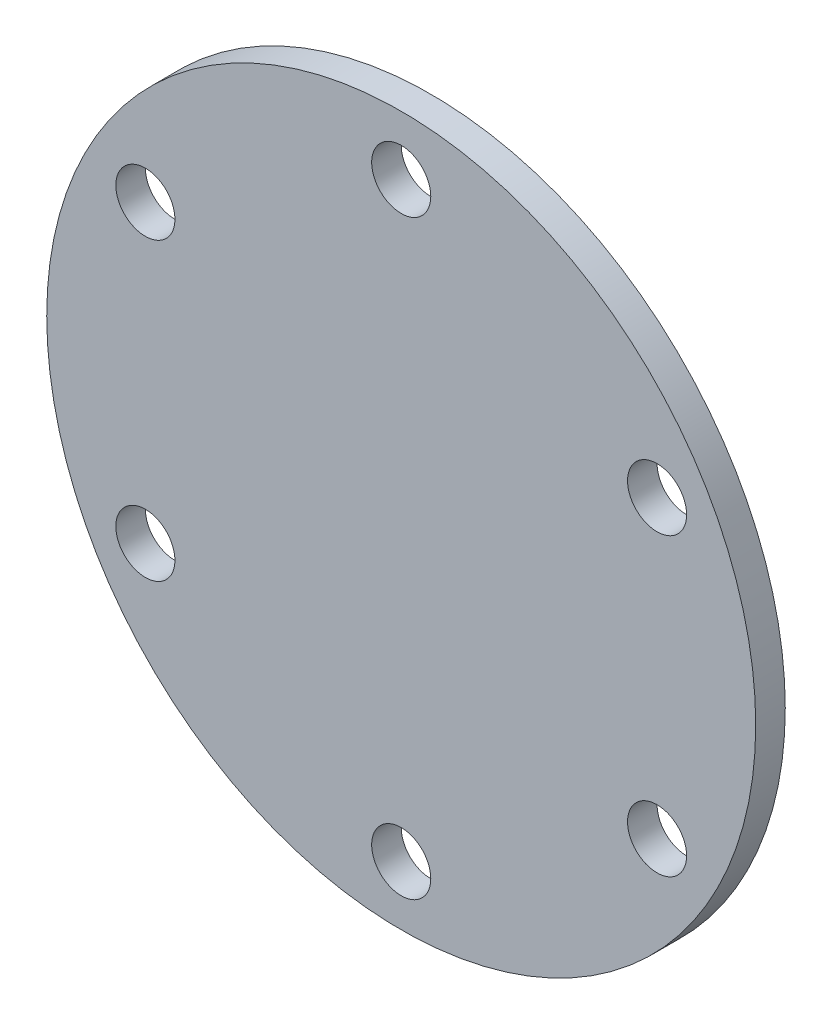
ISO-10303-21;
HEADER;
FILE_DESCRIPTION(('STEP AP214'),'2;1');
FILE_NAME('part.step','',(''),(''),'','','');
FILE_SCHEMA(('AUTOMOTIVE_DESIGN { 1 0 10303 214 1 1 1 1 }'));
ENDSEC;
DATA;
#1=APPLICATION_CONTEXT('core data for automotive mechanical design processes');
#2=APPLICATION_PROTOCOL_DEFINITION('international standard','automotive_design',2000,#1);
#3=PRODUCT_CONTEXT('',#1,'mechanical');
#4=PRODUCT('Part','Part','',(#3));
#5=PRODUCT_RELATED_PRODUCT_CATEGORY('part','',(#4));
#6=PRODUCT_DEFINITION_FORMATION('','',#4);
#7=PRODUCT_DEFINITION_CONTEXT('part definition',#1,'design');
#8=PRODUCT_DEFINITION('design','',#6,#7);
#9=PRODUCT_DEFINITION_SHAPE('','',#8);
#10=(LENGTH_UNIT() NAMED_UNIT(*) SI_UNIT(.MILLI.,.METRE.));
#11=(NAMED_UNIT(*) PLANE_ANGLE_UNIT() SI_UNIT($,.RADIAN.));
#12=(NAMED_UNIT(*) SI_UNIT($,.STERADIAN.) SOLID_ANGLE_UNIT());
#13=UNCERTAINTY_MEASURE_WITH_UNIT(LENGTH_MEASURE(1.E-05),#10,'distance_accuracy_value','');
#14=(GEOMETRIC_REPRESENTATION_CONTEXT(3) GLOBAL_UNCERTAINTY_ASSIGNED_CONTEXT((#13)) GLOBAL_UNIT_ASSIGNED_CONTEXT((#10,
#11,#12)) REPRESENTATION_CONTEXT('',''));
#15=CARTESIAN_POINT('',(0.,0.,0.));
#16=DIRECTION('',(0.,0.,1.));
#17=DIRECTION('',(1.,0.,0.));
#18=AXIS2_PLACEMENT_3D('',#15,#16,#17);
#19=CARTESIAN_POINT('',(0.,0.,5.));
#20=DIRECTION('',(0.,0.,1.));
#21=DIRECTION('',(1.,0.,0.));
#22=AXIS2_PLACEMENT_3D('',#19,#20,#21);
#23=PLANE('',#22);
#24=CARTESIAN_POINT('',(-43.3012701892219,-25.,5.));
#25=DIRECTION('',(0.,0.,1.));
#26=DIRECTION('',(1.,0.,0.));
#27=AXIS2_PLACEMENT_3D('',#24,#25,#26);
#28=CIRCLE('',#27,5.00000000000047);
#29=CARTESIAN_POINT('',(-38.3012701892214,-25.,5.));
#30=VERTEX_POINT('',#29);
#31=EDGE_CURVE('E87',#30,#30,#28,.T.);
#32=ORIENTED_EDGE('',*,*,#31,.F.);
#33=EDGE_LOOP('',(#32));
#34=FACE_BOUND('',#33,.T.);
#35=CARTESIAN_POINT('',(43.3012701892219,-25.,5.));
#36=DIRECTION('',(0.,0.,1.));
#37=DIRECTION('',(1.,0.,0.));
#38=AXIS2_PLACEMENT_3D('',#35,#36,#37);
#39=CIRCLE('',#38,5.00000000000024);
#40=CARTESIAN_POINT('',(48.3012701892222,-25.,5.));
#41=VERTEX_POINT('',#40);
#42=EDGE_CURVE('E61',#41,#41,#39,.T.);
#43=ORIENTED_EDGE('',*,*,#42,.F.);
#44=EDGE_LOOP('',(#43));
#45=FACE_BOUND('',#44,.T.);
#46=CARTESIAN_POINT('',(0.,50.,5.));
#47=DIRECTION('',(0.,0.,1.));
#48=DIRECTION('',(1.,0.,0.));
#49=AXIS2_PLACEMENT_3D('',#46,#47,#48);
#50=CIRCLE('',#49,5.);
#51=CARTESIAN_POINT('',(5.,50.,5.));
#52=VERTEX_POINT('',#51);
#53=EDGE_CURVE('E43',#52,#52,#50,.T.);
#54=ORIENTED_EDGE('',*,*,#53,.F.);
#55=EDGE_LOOP('',(#54));
#56=FACE_BOUND('',#55,.T.);
#57=CARTESIAN_POINT('',(0.,0.,5.));
#58=DIRECTION('',(0.,0.,1.));
#59=DIRECTION('',(1.,0.,0.));
#60=AXIS2_PLACEMENT_3D('',#57,#58,#59);
#61=CIRCLE('',#60,60.);
#62=CARTESIAN_POINT('',(60.,0.,5.));
#63=VERTEX_POINT('',#62);
#64=EDGE_CURVE('E11',#63,#63,#61,.T.);
#65=ORIENTED_EDGE('',*,*,#64,.T.);
#66=EDGE_LOOP('',(#65));
#67=FACE_BOUND('',#66,.T.);
#68=CARTESIAN_POINT('',(43.301270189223,25.,5.));
#69=DIRECTION('',(0.,0.,1.));
#70=DIRECTION('',(1.,0.,0.));
#71=AXIS2_PLACEMENT_3D('',#68,#69,#70);
#72=CIRCLE('',#71,4.9999999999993);
#73=CARTESIAN_POINT('',(48.3012701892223,25.,5.));
#74=VERTEX_POINT('',#73);
#75=EDGE_CURVE('E60',#74,#74,#72,.T.);
#76=ORIENTED_EDGE('',*,*,#75,.F.);
#77=EDGE_LOOP('',(#76));
#78=FACE_BOUND('',#77,.T.);
#79=CARTESIAN_POINT('',(0.,-50.,5.));
#80=DIRECTION('',(0.,0.,1.));
#81=DIRECTION('',(1.,0.,0.));
#82=AXIS2_PLACEMENT_3D('',#79,#80,#81);
#83=CIRCLE('',#82,5.00000000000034);
#84=CARTESIAN_POINT('',(5.00000000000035,-50.,5.));
#85=VERTEX_POINT('',#84);
#86=EDGE_CURVE('E80',#85,#85,#83,.T.);
#87=ORIENTED_EDGE('',*,*,#86,.F.);
#88=EDGE_LOOP('',(#87));
#89=FACE_BOUND('',#88,.T.);
#90=CARTESIAN_POINT('',(-43.301270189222,25.,5.));
#91=DIRECTION('',(0.,0.,1.));
#92=DIRECTION('',(1.,0.,0.));
#93=AXIS2_PLACEMENT_3D('',#90,#91,#92);
#94=CIRCLE('',#93,5.0000000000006);
#95=CARTESIAN_POINT('',(-38.3012701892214,25.,5.));
#96=VERTEX_POINT('',#95);
#97=EDGE_CURVE('E100',#96,#96,#94,.T.);
#98=ORIENTED_EDGE('',*,*,#97,.F.);
#99=EDGE_LOOP('',(#98));
#100=FACE_BOUND('',#99,.T.);
#101=ADVANCED_FACE('F31',(#34,#45,#56,#67,#78,#89,#100),#23,.T.);
#102=CARTESIAN_POINT('',(0.,0.,0.));
#103=DIRECTION('',(0.,0.,1.));
#104=DIRECTION('',(1.,0.,0.));
#105=AXIS2_PLACEMENT_3D('',#102,#103,#104);
#106=PLANE('',#105);
#107=CARTESIAN_POINT('',(0.,0.,0.));
#108=DIRECTION('',(0.,0.,1.));
#109=DIRECTION('',(1.,0.,0.));
#110=AXIS2_PLACEMENT_3D('',#107,#108,#109);
#111=CIRCLE('',#110,60.);
#112=CARTESIAN_POINT('',(60.,0.,0.));
#113=VERTEX_POINT('',#112);
#114=EDGE_CURVE('E35',#113,#113,#111,.T.);
#115=ORIENTED_EDGE('',*,*,#114,.F.);
#116=EDGE_LOOP('',(#115));
#117=FACE_BOUND('',#116,.T.);
#118=CARTESIAN_POINT('',(0.,50.,0.));
#119=DIRECTION('',(0.,0.,1.));
#120=DIRECTION('',(1.,0.,0.));
#121=AXIS2_PLACEMENT_3D('',#118,#119,#120);
#122=CIRCLE('',#121,5.);
#123=CARTESIAN_POINT('',(5.,50.,0.));
#124=VERTEX_POINT('',#123);
#125=EDGE_CURVE('E45',#124,#124,#122,.T.);
#126=ORIENTED_EDGE('',*,*,#125,.T.);
#127=EDGE_LOOP('',(#126));
#128=FACE_BOUND('',#127,.T.);
#129=CARTESIAN_POINT('',(43.301270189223,25.,0.));
#130=DIRECTION('',(0.,0.,1.));
#131=DIRECTION('',(1.,0.,0.));
#132=AXIS2_PLACEMENT_3D('',#129,#130,#131);
#133=CIRCLE('',#132,4.9999999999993);
#134=CARTESIAN_POINT('',(48.3012701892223,25.,0.));
#135=VERTEX_POINT('',#134);
#136=EDGE_CURVE('E56',#135,#135,#133,.T.);
#137=ORIENTED_EDGE('',*,*,#136,.T.);
#138=EDGE_LOOP('',(#137));
#139=FACE_BOUND('',#138,.T.);
#140=CARTESIAN_POINT('',(43.3012701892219,-25.,0.));
#141=DIRECTION('',(0.,0.,1.));
#142=DIRECTION('',(1.,0.,0.));
#143=AXIS2_PLACEMENT_3D('',#140,#141,#142);
#144=CIRCLE('',#143,5.00000000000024);
#145=CARTESIAN_POINT('',(48.3012701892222,-25.,0.));
#146=VERTEX_POINT('',#145);
#147=EDGE_CURVE('E74',#146,#146,#144,.T.);
#148=ORIENTED_EDGE('',*,*,#147,.T.);
#149=EDGE_LOOP('',(#148));
#150=FACE_BOUND('',#149,.T.);
#151=CARTESIAN_POINT('',(0.,-50.,0.));
#152=DIRECTION('',(0.,0.,1.));
#153=DIRECTION('',(1.,0.,0.));
#154=AXIS2_PLACEMENT_3D('',#151,#152,#153);
#155=CIRCLE('',#154,5.00000000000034);
#156=CARTESIAN_POINT('',(5.00000000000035,-50.,0.));
#157=VERTEX_POINT('',#156);
#158=EDGE_CURVE('E75',#157,#157,#155,.T.);
#159=ORIENTED_EDGE('',*,*,#158,.T.);
#160=EDGE_LOOP('',(#159));
#161=FACE_BOUND('',#160,.T.);
#162=CARTESIAN_POINT('',(-43.3012701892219,-25.,0.));
#163=DIRECTION('',(0.,0.,1.));
#164=DIRECTION('',(1.,0.,0.));
#165=AXIS2_PLACEMENT_3D('',#162,#163,#164);
#166=CIRCLE('',#165,5.00000000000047);
#167=CARTESIAN_POINT('',(-38.3012701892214,-25.,0.));
#168=VERTEX_POINT('',#167);
#169=EDGE_CURVE('E89',#168,#168,#166,.T.);
#170=ORIENTED_EDGE('',*,*,#169,.T.);
#171=EDGE_LOOP('',(#170));
#172=FACE_BOUND('',#171,.T.);
#173=CARTESIAN_POINT('',(-43.301270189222,25.,0.));
#174=DIRECTION('',(0.,0.,1.));
#175=DIRECTION('',(1.,0.,0.));
#176=AXIS2_PLACEMENT_3D('',#173,#174,#175);
#177=CIRCLE('',#176,5.0000000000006);
#178=CARTESIAN_POINT('',(-38.3012701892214,25.,0.));
#179=VERTEX_POINT('',#178);
#180=EDGE_CURVE('E96',#179,#179,#177,.T.);
#181=ORIENTED_EDGE('',*,*,#180,.T.);
#182=EDGE_LOOP('',(#181));
#183=FACE_BOUND('',#182,.T.);
#184=ADVANCED_FACE('F109',(#117,#128,#139,#150,#161,#172,#183),#106,.F.);
#185=CARTESIAN_POINT('',(0.,0.,5.));
#186=DIRECTION('',(0.,0.,-1.));
#187=DIRECTION('',(-1.,0.,0.));
#188=AXIS2_PLACEMENT_3D('',#185,#186,#187);
#189=CYLINDRICAL_SURFACE('',#188,60.);
#190=ORIENTED_EDGE('',*,*,#64,.F.);
#191=EDGE_LOOP('',(#190));
#192=FACE_BOUND('',#191,.T.);
#193=ORIENTED_EDGE('',*,*,#114,.T.);
#194=EDGE_LOOP('',(#193));
#195=FACE_BOUND('',#194,.T.);
#196=ADVANCED_FACE('F33',(#192,#195),#189,.T.);
#197=CARTESIAN_POINT('',(0.,50.,5.));
#198=DIRECTION('',(0.,0.,-1.));
#199=DIRECTION('',(-1.,0.,0.));
#200=AXIS2_PLACEMENT_3D('',#197,#198,#199);
#201=CYLINDRICAL_SURFACE('',#200,5.);
#202=ORIENTED_EDGE('',*,*,#53,.T.);
#203=EDGE_LOOP('',(#202));
#204=FACE_BOUND('',#203,.T.);
#205=ORIENTED_EDGE('',*,*,#125,.F.);
#206=EDGE_LOOP('',(#205));
#207=FACE_BOUND('',#206,.T.);
#208=ADVANCED_FACE('F135',(#204,#207),#201,.F.);
#209=CARTESIAN_POINT('',(43.301270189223,25.,5.));
#210=DIRECTION('',(0.,0.,-1.));
#211=DIRECTION('',(-1.,0.,0.));
#212=AXIS2_PLACEMENT_3D('',#209,#210,#211);
#213=CYLINDRICAL_SURFACE('',#212,4.9999999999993);
#214=ORIENTED_EDGE('',*,*,#75,.T.);
#215=EDGE_LOOP('',(#214));
#216=FACE_BOUND('',#215,.T.);
#217=ORIENTED_EDGE('',*,*,#136,.F.);
#218=EDGE_LOOP('',(#217));
#219=FACE_BOUND('',#218,.T.);
#220=ADVANCED_FACE('F138',(#216,#219),#213,.F.);
#221=CARTESIAN_POINT('',(43.3012701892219,-25.,5.));
#222=DIRECTION('',(0.,0.,-1.));
#223=DIRECTION('',(-1.,0.,0.));
#224=AXIS2_PLACEMENT_3D('',#221,#222,#223);
#225=CYLINDRICAL_SURFACE('',#224,5.00000000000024);
#226=ORIENTED_EDGE('',*,*,#42,.T.);
#227=EDGE_LOOP('',(#226));
#228=FACE_BOUND('',#227,.T.);
#229=ORIENTED_EDGE('',*,*,#147,.F.);
#230=EDGE_LOOP('',(#229));
#231=FACE_BOUND('',#230,.T.);
#232=ADVANCED_FACE('F123',(#228,#231),#225,.F.);
#233=CARTESIAN_POINT('',(0.,-50.,5.));
#234=DIRECTION('',(0.,0.,-1.));
#235=DIRECTION('',(-1.,0.,0.));
#236=AXIS2_PLACEMENT_3D('',#233,#234,#235);
#237=CYLINDRICAL_SURFACE('',#236,5.00000000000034);
#238=ORIENTED_EDGE('',*,*,#86,.T.);
#239=EDGE_LOOP('',(#238));
#240=FACE_BOUND('',#239,.T.);
#241=ORIENTED_EDGE('',*,*,#158,.F.);
#242=EDGE_LOOP('',(#241));
#243=FACE_BOUND('',#242,.T.);
#244=ADVANCED_FACE('F115',(#240,#243),#237,.F.);
#245=CARTESIAN_POINT('',(-43.3012701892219,-25.,5.));
#246=DIRECTION('',(0.,0.,-1.));
#247=DIRECTION('',(-1.,0.,0.));
#248=AXIS2_PLACEMENT_3D('',#245,#246,#247);
#249=CYLINDRICAL_SURFACE('',#248,5.00000000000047);
#250=ORIENTED_EDGE('',*,*,#31,.T.);
#251=EDGE_LOOP('',(#250));
#252=FACE_BOUND('',#251,.T.);
#253=ORIENTED_EDGE('',*,*,#169,.F.);
#254=EDGE_LOOP('',(#253));
#255=FACE_BOUND('',#254,.T.);
#256=ADVANCED_FACE('F112',(#252,#255),#249,.F.);
#257=CARTESIAN_POINT('',(-43.301270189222,25.,5.));
#258=DIRECTION('',(0.,0.,-1.));
#259=DIRECTION('',(-1.,0.,0.));
#260=AXIS2_PLACEMENT_3D('',#257,#258,#259);
#261=CYLINDRICAL_SURFACE('',#260,5.0000000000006);
#262=ORIENTED_EDGE('',*,*,#97,.T.);
#263=EDGE_LOOP('',(#262));
#264=FACE_BOUND('',#263,.T.);
#265=ORIENTED_EDGE('',*,*,#180,.F.);
#266=EDGE_LOOP('',(#265));
#267=FACE_BOUND('',#266,.T.);
#268=ADVANCED_FACE('F114',(#264,#267),#261,.F.);
#269=CLOSED_SHELL('',(#101,#184,#196,#208,#220,#232,#244,#256,#268));
#270=MANIFOLD_SOLID_BREP('B2',#269);
#271=ADVANCED_BREP_SHAPE_REPRESENTATION('',(#18,#270),#14);
#272=SHAPE_DEFINITION_REPRESENTATION(#9,#271);
ENDSEC;
END-ISO-10303-21;
